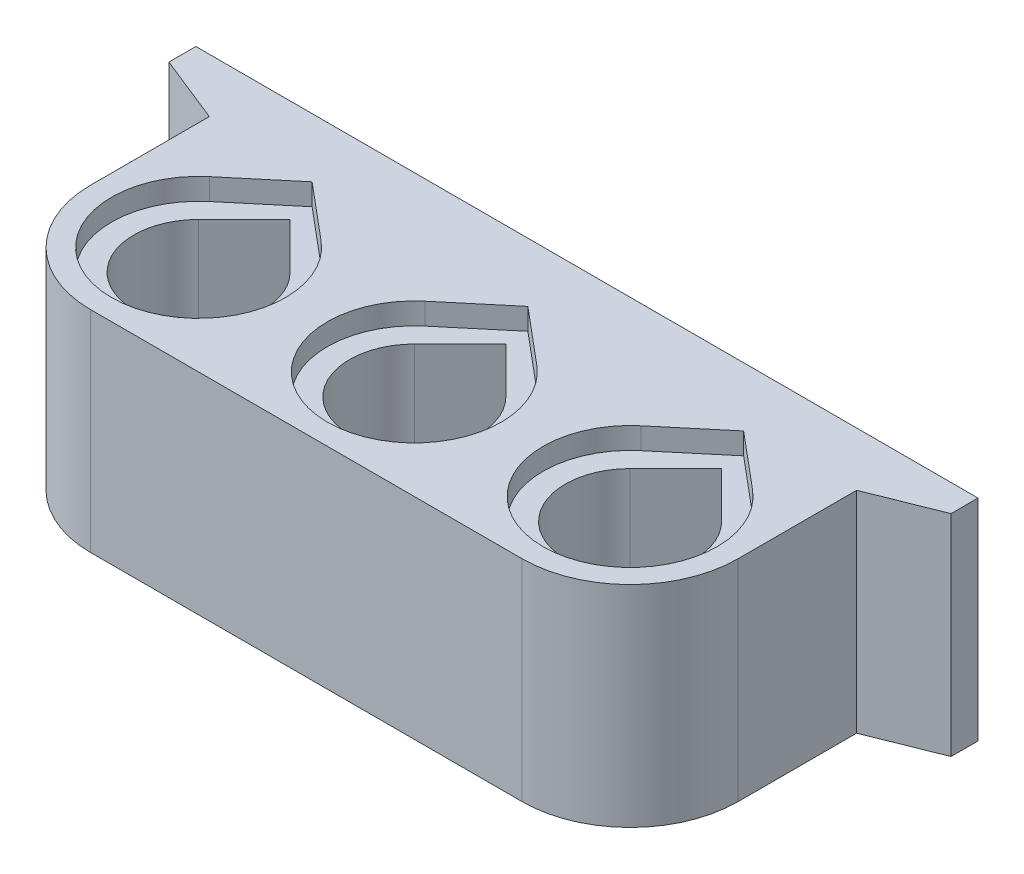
from build123d import *

# Parameters (mm, degrees)
AUFSATZ_LINEAR_AUSTRAGEN1_DEPTH = 7.8
SCHNITT_LINEAR_AUSTRAGEN1_DEPTH = 0.8
VERRUNDUNG1_R                   = 4


with BuildPart() as part:
    # Skizze1 → Aufsatz-Linear austragen1 (new body)
    with BuildSketch(Plane(origin=(0, 0, 0), x_dir=(1, 0, 0), z_dir=(0, 1, 0))):
        Polygon((0, 0), (24, 0), (24, 8.4), (26.5, 9.4), (26.5, 10.4), (24, 10.4), (0, 10.4), (-2.5, 10.4), (-2.5, 9.4), (0, 8.4), align=None)
        with BuildLine():
            Line((4, 7.39411255), (5.697056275, 5.697056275))
            ThreePointArc((5.697056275, 5.697056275), (4, 1.6), (2.302943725, 5.697056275))
            Line((2.302943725, 5.697056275), (4, 7.39411255))
        make_face(mode=Mode.SUBTRACT)
        with BuildLine():
            Line((12, 7.39411255), (13.697056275, 5.697056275))
            ThreePointArc((13.697056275, 5.697056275), (12, 1.6), (10.302943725, 5.697056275))
            Line((10.302943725, 5.697056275), (12, 7.39411255))
        make_face(mode=Mode.SUBTRACT)
        with BuildLine():
            Line((20, 7.39411255), (21.697056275, 5.697056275))
            ThreePointArc((21.697056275, 5.697056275), (20, 1.6), (18.302943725, 5.697056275))
            Line((18.302943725, 5.697056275), (20, 7.39411255))
        make_face(mode=Mode.SUBTRACT)
    extrude(amount=AUFSATZ_LINEAR_AUSTRAGEN1_DEPTH)

    # Skizze2 → Schnitt-Linear austragen1 (cut)
    with BuildSketch(Plane(origin=(0, 7.8, 0), x_dir=(1, 0, 0), z_dir=(0, 1, 0))):
        with BuildLine():
            Line((4, 8.209938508), (1.927009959, 6.470493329))
            ThreePointArc((1.927009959, 6.470493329), (4, 0.775), (6.072990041, 6.470493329))
            Line((6.072990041, 6.470493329), (4, 8.209938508))
        make_face()
        with BuildLine():
            Line((12, 8.209938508), (9.927009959, 6.470493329))
            ThreePointArc((9.927009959, 6.470493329), (12, 0.775), (14.072990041, 6.470493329))
            Line((14.072990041, 6.470493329), (12, 8.209938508))
        make_face()
        with BuildLine():
            Line((20, 8.209938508), (17.927009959, 6.470493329))
            ThreePointArc((17.927009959, 6.470493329), (20, 0.775), (22.072990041, 6.470493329))
            Line((22.072990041, 6.470493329), (20, 8.209938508))
        make_face()
    schnitt_linear_austragen1 = extrude(amount=-SCHNITT_LINEAR_AUSTRAGEN1_DEPTH, mode=Mode.SUBTRACT)

    # Spiegeln1: Schnitt-Linear austragen1 across plane
    add(schnitt_linear_austragen1.mirror(Plane.ZX.offset(3.9)), mode=Mode.SUBTRACT)

    # Verrundung1
    verrundung1_edges = [part.edges().sort_by_distance(p)[0] for p in [
        (24, 3.9, 0),
        (0, 3.9, 0),
    ]]
    fillet(verrundung1_edges, radius=VERRUNDUNG1_R)


solid = part.part
